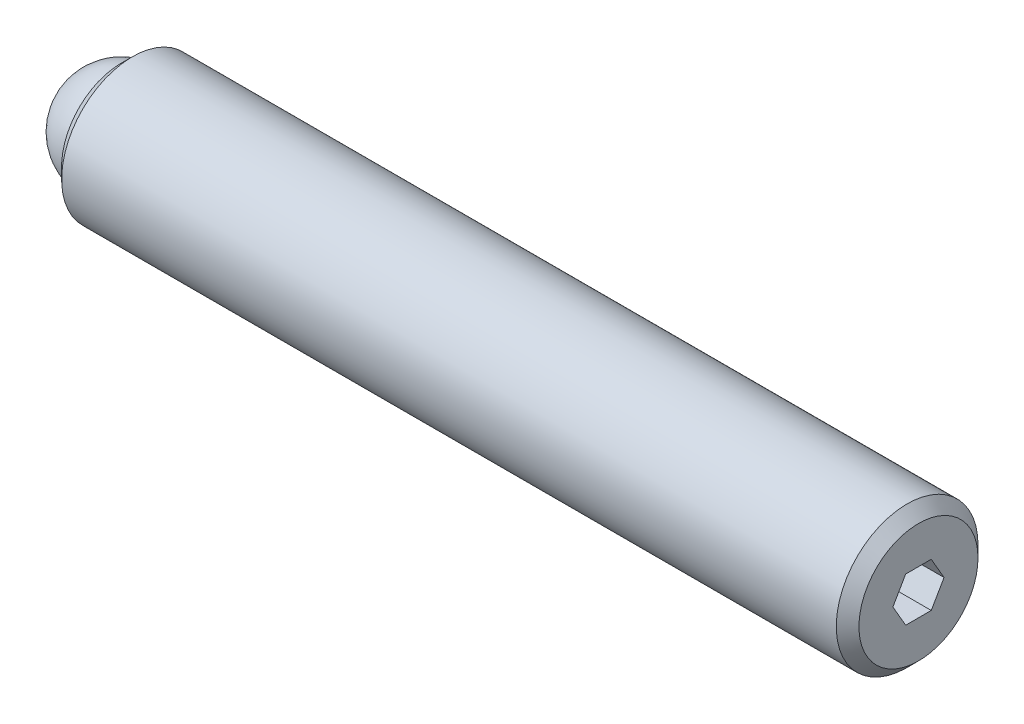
from build123d import *

# Parameters (mm, degrees)
SKETCH2_R           = 3.175
BOSS_EXTRUDE1_DEPTH = 35.71875
CHAMFER1_SIZE       = 0.508
CHAMFER2_SIZE       = 0.508
CUT_EXTRUDE2_DEPTH  = 2.286
SKETCH3_R           = 2.38125
CUT_EXTRUDE3_DEPTH  = 2.38125
CUT_EXTRUDE4_DEPTH  = 2.38125


with BuildPart() as part:
    # Sketch2 → Boss-Extrude1 (new body)
    with BuildSketch(Plane(origin=(0, 0, 0), x_dir=(0, 0, -1), z_dir=(1, 0, 0))):
        Circle(SKETCH2_R)
    extrude(amount=BOSS_EXTRUDE1_DEPTH)

    # Chamfer1
    chamfer1_edges = [part.edges().sort_by_distance(p)[0] for p in [
        (0, 0, 3.175),
    ]]
    chamfer(chamfer1_edges, length=CHAMFER1_SIZE)

    # Chamfer2
    chamfer2_edges = [part.edges().sort_by_distance(p)[0] for p in [
        (35.71875, 0, 3.175),
    ]]
    chamfer(chamfer2_edges, length=CHAMFER2_SIZE)

    # Sketch4 → Cut-Extrude2 (cut)
    with BuildSketch(Plane(origin=(35.71875, 0, 0), x_dir=(0, 0, -1), z_dir=(1, 0, 0))):
        Polygon((1.14567944, 0), (0.57283972, 0.9921875), (-0.57283972, 0.9921875), (-1.14567944, 0), (-0.57283972, -0.9921875), (0.57283972, -0.9921875), align=None)
    extrude(amount=-CUT_EXTRUDE2_DEPTH, mode=Mode.SUBTRACT)

    # Sketch3 → Cut-Extrude3 (cut)
    with BuildSketch(Plane.ZY):
        Circle(SKETCH3_R)
    extrude(amount=-CUT_EXTRUDE3_DEPTH, mode=Mode.SUBTRACT)

    # Sketch7 → Cut-Extrude4 (cut)
    with BuildSketch(Plane.ZY):
        with BuildLine():
            ThreePointArc((0.063494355, 2.380403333), (0, 2.38125), (-0.063494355, 2.380403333))
            ThreePointArc((-0.063494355, 2.380403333), (0, 2.44475), (0.063494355, 2.380403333))
        make_face()
    extrude(amount=-CUT_EXTRUDE4_DEPTH, mode=Mode.SUBTRACT)


with BuildPart() as body_2:
    # Sketch5 → Revolve1 (revolve)
    with BuildSketch(Plane.ZY):
        with BuildLine():
            Line((0, 0), (0, -2.38125))
            ThreePointArc((0, -2.38125), (-2.38125, 0), (0, 2.38125))
            Line((0, 2.38125), (0, 0))
        make_face()
    revolve(axis=Axis((0, 0, 0), (0, 1, 0)))


solid = Compound([part.part, body_2.part])
